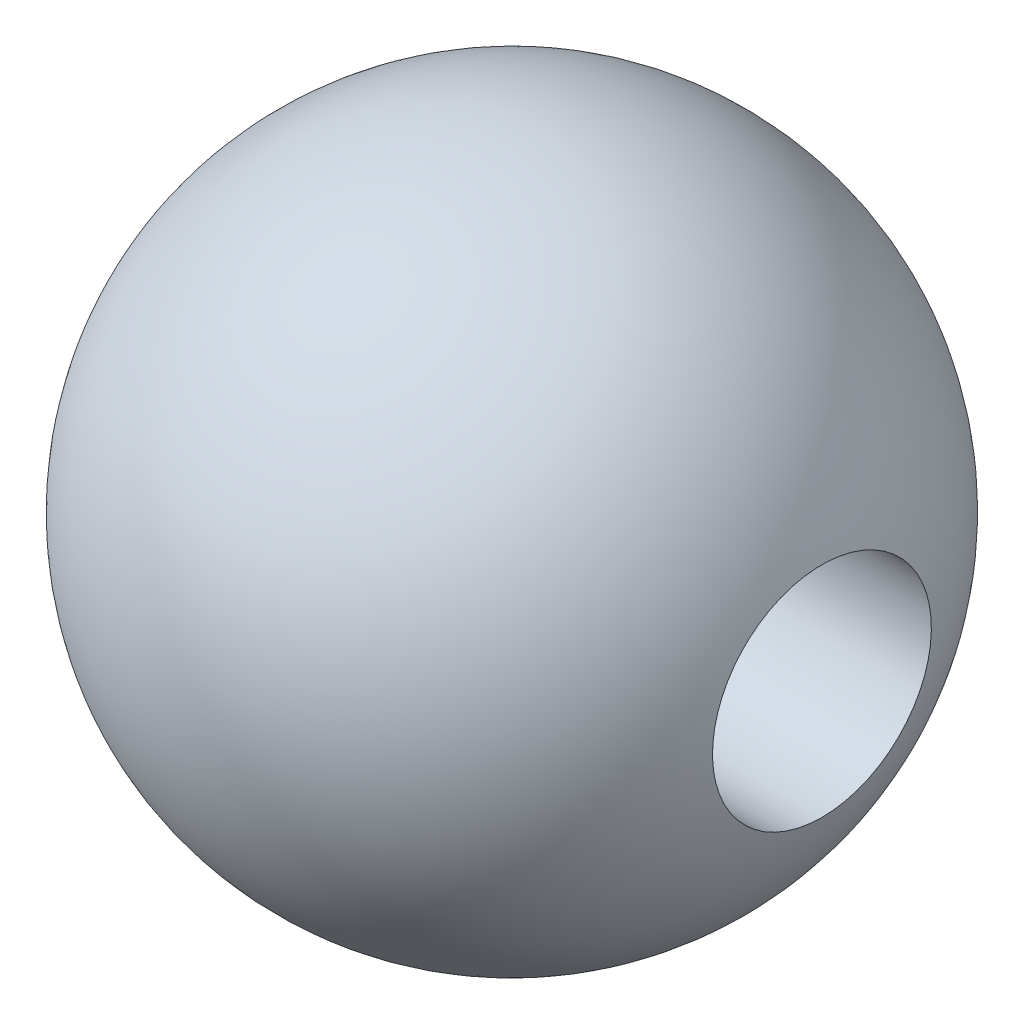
ISO-10303-21;
HEADER;
FILE_DESCRIPTION(('STEP AP214'),'2;1');
FILE_NAME('part.step','',(''),(''),'','','');
FILE_SCHEMA(('AUTOMOTIVE_DESIGN { 1 0 10303 214 1 1 1 1 }'));
ENDSEC;
DATA;
#1=APPLICATION_CONTEXT('core data for automotive mechanical design processes');
#2=APPLICATION_PROTOCOL_DEFINITION('international standard','automotive_design',2000,#1);
#3=PRODUCT_CONTEXT('',#1,'mechanical');
#4=PRODUCT('Part','Part','',(#3));
#5=PRODUCT_RELATED_PRODUCT_CATEGORY('part','',(#4));
#6=PRODUCT_DEFINITION_FORMATION('','',#4);
#7=PRODUCT_DEFINITION_CONTEXT('part definition',#1,'design');
#8=PRODUCT_DEFINITION('design','',#6,#7);
#9=PRODUCT_DEFINITION_SHAPE('','',#8);
#10=(LENGTH_UNIT() NAMED_UNIT(*) SI_UNIT(.MILLI.,.METRE.));
#11=(NAMED_UNIT(*) PLANE_ANGLE_UNIT() SI_UNIT($,.RADIAN.));
#12=(NAMED_UNIT(*) SI_UNIT($,.STERADIAN.) SOLID_ANGLE_UNIT());
#13=UNCERTAINTY_MEASURE_WITH_UNIT(LENGTH_MEASURE(1.E-05),#10,'distance_accuracy_value','');
#14=(GEOMETRIC_REPRESENTATION_CONTEXT(3) GLOBAL_UNCERTAINTY_ASSIGNED_CONTEXT((#13)) GLOBAL_UNIT_ASSIGNED_CONTEXT((#10,
#11,#12)) REPRESENTATION_CONTEXT('',''));
#15=CARTESIAN_POINT('',(0.,0.,0.));
#16=DIRECTION('',(0.,0.,1.));
#17=DIRECTION('',(1.,0.,0.));
#18=AXIS2_PLACEMENT_3D('',#15,#16,#17);
#19=CARTESIAN_POINT('',(-5.78937914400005,0.,0.));
#20=DIRECTION('',(-1.,0.,0.));
#21=DIRECTION('',(0.,-1.,0.));
#22=AXIS2_PLACEMENT_3D('',#19,#20,#21);
#23=DEGENERATE_TOROIDAL_SURFACE('',#22,0.0252007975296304,6.,.T.);
#24=CARTESIAN_POINT('',(-11.,0.,0.));
#25=DIRECTION('',(-1.,0.,0.));
#26=DIRECTION('',(0.,-1.,0.));
#27=AXIS2_PLACEMENT_3D('',#24,#25,#26);
#28=CIRCLE('',#27,3.);
#29=CARTESIAN_POINT('',(-11.,-3.,0.));
#30=VERTEX_POINT('',#29);
#31=EDGE_CURVE('E10',#30,#30,#28,.T.);
#32=ORIENTED_EDGE('',*,*,#31,.F.);
#33=EDGE_LOOP('',(#32));
#34=FACE_BOUND('',#33,.T.);
#35=CARTESIAN_POINT('',(-0.12367811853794,0.,0.));
#36=DIRECTION('',(-1.,0.,0.));
#37=DIRECTION('',(0.,-1.,0.));
#38=AXIS2_PLACEMENT_3D('',#35,#36,#37);
#39=CIRCLE('',#38,2.);
#40=CARTESIAN_POINT('',(-0.12367811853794,-1.99999999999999,0.));
#41=VERTEX_POINT('',#40);
#42=EDGE_CURVE('E41',#41,#41,#39,.T.);
#43=ORIENTED_EDGE('',*,*,#42,.T.);
#44=EDGE_LOOP('',(#43));
#45=FACE_BOUND('',#44,.T.);
#46=ADVANCED_FACE('F31',(#34,#45),#23,.T.);
#47=CARTESIAN_POINT('',(-11.,0.,0.));
#48=DIRECTION('',(-1.,0.,0.));
#49=DIRECTION('',(0.,-1.,0.));
#50=AXIS2_PLACEMENT_3D('',#47,#48,#49);
#51=CONICAL_SURFACE('',#50,3.,0.78539816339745);
#52=CARTESIAN_POINT('',(-10.,0.,0.));
#53=DIRECTION('',(-1.,0.,0.));
#54=DIRECTION('',(0.,-1.,0.));
#55=AXIS2_PLACEMENT_3D('',#52,#53,#54);
#56=CIRCLE('',#55,2.);
#57=CARTESIAN_POINT('',(-10.,-2.,0.));
#58=VERTEX_POINT('',#57);
#59=EDGE_CURVE('E37',#58,#58,#56,.T.);
#60=ORIENTED_EDGE('',*,*,#59,.F.);
#61=EDGE_LOOP('',(#60));
#62=FACE_BOUND('',#61,.T.);
#63=ORIENTED_EDGE('',*,*,#31,.T.);
#64=EDGE_LOOP('',(#63));
#65=FACE_BOUND('',#64,.T.);
#66=ADVANCED_FACE('F51',(#62,#65),#51,.F.);
#67=CARTESIAN_POINT('',(-11.,0.,0.));
#68=DIRECTION('',(-1.,0.,0.));
#69=DIRECTION('',(0.,-1.,0.));
#70=AXIS2_PLACEMENT_3D('',#67,#68,#69);
#71=CYLINDRICAL_SURFACE('',#70,2.);
#72=ORIENTED_EDGE('',*,*,#42,.F.);
#73=EDGE_LOOP('',(#72));
#74=FACE_BOUND('',#73,.T.);
#75=ORIENTED_EDGE('',*,*,#59,.T.);
#76=EDGE_LOOP('',(#75));
#77=FACE_BOUND('',#76,.T.);
#78=ADVANCED_FACE('F49',(#74,#77),#71,.F.);
#79=CLOSED_SHELL('',(#46,#66,#78));
#80=MANIFOLD_SOLID_BREP('B2',#79);
#81=ADVANCED_BREP_SHAPE_REPRESENTATION('',(#18,#80),#14);
#82=SHAPE_DEFINITION_REPRESENTATION(#9,#81);
ENDSEC;
END-ISO-10303-21;
